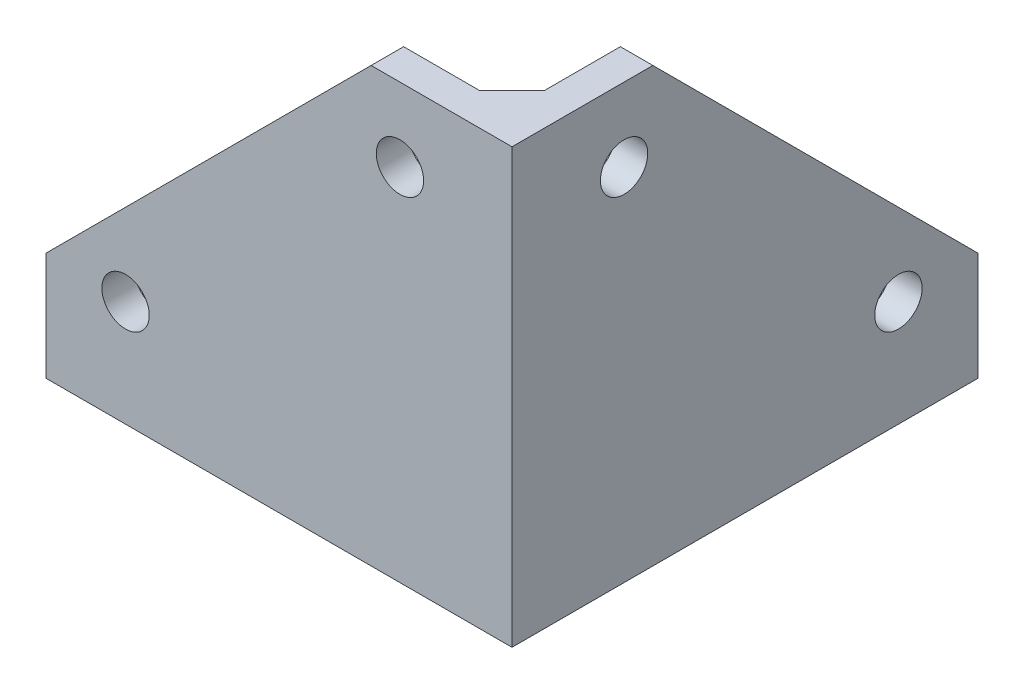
ISO-10303-21;
HEADER;
FILE_DESCRIPTION(('STEP AP214'),'2;1');
FILE_NAME('part.step','',(''),(''),'','','');
FILE_SCHEMA(('AUTOMOTIVE_DESIGN { 1 0 10303 214 1 1 1 1 }'));
ENDSEC;
DATA;
#1=APPLICATION_CONTEXT('core data for automotive mechanical design processes');
#2=APPLICATION_PROTOCOL_DEFINITION('international standard','automotive_design',2000,#1);
#3=PRODUCT_CONTEXT('',#1,'mechanical');
#4=PRODUCT('Part','Part','',(#3));
#5=PRODUCT_RELATED_PRODUCT_CATEGORY('part','',(#4));
#6=PRODUCT_DEFINITION_FORMATION('','',#4);
#7=PRODUCT_DEFINITION_CONTEXT('part definition',#1,'design');
#8=PRODUCT_DEFINITION('design','',#6,#7);
#9=PRODUCT_DEFINITION_SHAPE('','',#8);
#10=(LENGTH_UNIT() NAMED_UNIT(*) SI_UNIT(.MILLI.,.METRE.));
#11=(NAMED_UNIT(*) PLANE_ANGLE_UNIT() SI_UNIT($,.RADIAN.));
#12=(NAMED_UNIT(*) SI_UNIT($,.STERADIAN.) SOLID_ANGLE_UNIT());
#13=UNCERTAINTY_MEASURE_WITH_UNIT(LENGTH_MEASURE(1.E-05),#10,'distance_accuracy_value','');
#14=(GEOMETRIC_REPRESENTATION_CONTEXT(3) GLOBAL_UNCERTAINTY_ASSIGNED_CONTEXT((#13)) GLOBAL_UNIT_ASSIGNED_CONTEXT((#10,
#11,#12)) REPRESENTATION_CONTEXT('',''));
#15=CARTESIAN_POINT('',(0.,0.,0.));
#16=DIRECTION('',(0.,0.,1.));
#17=DIRECTION('',(1.,0.,0.));
#18=AXIS2_PLACEMENT_3D('',#15,#16,#17);
#19=CARTESIAN_POINT('',(-20.,3.,0.));
#20=DIRECTION('',(-1.,0.,0.));
#21=DIRECTION('',(0.,0.,1.));
#22=AXIS2_PLACEMENT_3D('',#19,#20,#21);
#23=PLANE('',#22);
#24=DIRECTION('',(0.,-1.,0.));
#25=VECTOR('',#24,1.);
#26=CARTESIAN_POINT('',(-20.,40.,20.));
#27=LINE('',#26,#25);
#28=CARTESIAN_POINT('',(-20.,9.99999999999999,20.));
#29=VERTEX_POINT('',#28);
#30=CARTESIAN_POINT('',(-20.,5.99999999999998,20.));
#31=VERTEX_POINT('',#30);
#32=EDGE_CURVE('E186',#29,#31,#27,.T.);
#33=ORIENTED_EDGE('',*,*,#32,.T.);
#34=DIRECTION('',(0.,0.707106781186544,0.707106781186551));
#35=VECTOR('',#34,1.);
#36=CARTESIAN_POINT('',(-20.,5.99999999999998,20.));
#37=LINE('',#36,#35);
#38=CARTESIAN_POINT('',(-20.,3.,17.));
#39=VERTEX_POINT('',#38);
#40=EDGE_CURVE('E53',#31,#39,#37,.F.);
#41=ORIENTED_EDGE('',*,*,#40,.T.);
#42=DIRECTION('',(0.,0.,-1.));
#43=VECTOR('',#42,1.);
#44=CARTESIAN_POINT('',(-20.,3.,0.));
#45=LINE('',#44,#43);
#46=CARTESIAN_POINT('',(-20.,3.,9.99999999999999));
#47=VERTEX_POINT('',#46);
#48=EDGE_CURVE('E206',#39,#47,#45,.T.);
#49=ORIENTED_EDGE('',*,*,#48,.T.);
#50=DIRECTION('',(0.,-1.,0.));
#51=VECTOR('',#50,1.);
#52=CARTESIAN_POINT('',(-20.,0.,9.99999999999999));
#53=LINE('',#52,#51);
#54=CARTESIAN_POINT('',(-20.,0.,9.99999999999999));
#55=VERTEX_POINT('',#54);
#56=EDGE_CURVE('E250',#47,#55,#53,.T.);
#57=ORIENTED_EDGE('',*,*,#56,.T.);
#58=DIRECTION('',(0.,0.,-1.));
#59=VECTOR('',#58,1.);
#60=CARTESIAN_POINT('',(-20.,0.,0.));
#61=LINE('',#60,#59);
#62=CARTESIAN_POINT('',(-20.,0.,23.));
#63=VERTEX_POINT('',#62);
#64=EDGE_CURVE('E220',#63,#55,#61,.T.);
#65=ORIENTED_EDGE('',*,*,#64,.F.);
#66=DIRECTION('',(0.,-1.,0.));
#67=VECTOR('',#66,1.);
#68=CARTESIAN_POINT('',(-20.,40.,23.));
#69=LINE('',#68,#67);
#70=CARTESIAN_POINT('',(-20.,9.99999999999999,23.));
#71=VERTEX_POINT('',#70);
#72=EDGE_CURVE('E161',#71,#63,#69,.T.);
#73=ORIENTED_EDGE('',*,*,#72,.F.);
#74=DIRECTION('',(0.,0.,-1.));
#75=VECTOR('',#74,1.);
#76=CARTESIAN_POINT('',(-20.,9.99999999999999,20.));
#77=LINE('',#76,#75);
#78=EDGE_CURVE('E212',#71,#29,#77,.T.);
#79=ORIENTED_EDGE('',*,*,#78,.T.);
#80=EDGE_LOOP('',(#33,#41,#49,#57,#65,#73,#79));
#81=FACE_BOUND('',#80,.T.);
#82=ADVANCED_FACE('F42',(#81),#23,.T.);
#83=CARTESIAN_POINT('',(-14.1977849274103,3.,14.1977849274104));
#84=DIRECTION('',(0.,-1.,0.));
#85=DIRECTION('',(0.,0.,-1.));
#86=AXIS2_PLACEMENT_3D('',#83,#84,#85);
#87=CYLINDRICAL_SURFACE('',#86,2.1844);
#88=CARTESIAN_POINT('',(-14.1977849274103,3.,14.1977849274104));
#89=DIRECTION('',(0.,1.,0.));
#90=DIRECTION('',(0.,0.,1.));
#91=AXIS2_PLACEMENT_3D('',#88,#89,#90);
#92=CIRCLE('',#91,2.1844);
#93=CARTESIAN_POINT('',(-14.1977849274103,3.,16.3821849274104));
#94=VERTEX_POINT('',#93);
#95=EDGE_CURVE('E201',#94,#94,#92,.T.);
#96=ORIENTED_EDGE('',*,*,#95,.T.);
#97=EDGE_LOOP('',(#96));
#98=FACE_BOUND('',#97,.T.);
#99=CARTESIAN_POINT('',(-14.1977849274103,0.,14.1977849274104));
#100=DIRECTION('',(0.,1.,0.));
#101=DIRECTION('',(0.,0.,1.));
#102=AXIS2_PLACEMENT_3D('',#99,#100,#101);
#103=CIRCLE('',#102,2.1844);
#104=CARTESIAN_POINT('',(-14.1977849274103,0.,16.3821849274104));
#105=VERTEX_POINT('',#104);
#106=EDGE_CURVE('E216',#105,#105,#103,.T.);
#107=ORIENTED_EDGE('',*,*,#106,.F.);
#108=EDGE_LOOP('',(#107));
#109=FACE_BOUND('',#108,.T.);
#110=ADVANCED_FACE('F364',(#98,#109),#87,.F.);
#111=CARTESIAN_POINT('',(14.1977849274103,3.,-14.1977849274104));
#112=DIRECTION('',(0.,-1.,0.));
#113=DIRECTION('',(0.,0.,-1.));
#114=AXIS2_PLACEMENT_3D('',#111,#112,#113);
#115=CYLINDRICAL_SURFACE('',#114,2.1844);
#116=CARTESIAN_POINT('',(14.1977849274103,3.,-14.1977849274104));
#117=DIRECTION('',(0.,1.,0.));
#118=DIRECTION('',(0.,0.,1.));
#119=AXIS2_PLACEMENT_3D('',#116,#117,#118);
#120=CIRCLE('',#119,2.1844);
#121=CARTESIAN_POINT('',(14.1977849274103,3.,-12.0133849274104));
#122=VERTEX_POINT('',#121);
#123=EDGE_CURVE('E197',#122,#122,#120,.T.);
#124=ORIENTED_EDGE('',*,*,#123,.T.);
#125=EDGE_LOOP('',(#124));
#126=FACE_BOUND('',#125,.T.);
#127=CARTESIAN_POINT('',(14.1977849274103,0.,-14.1977849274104));
#128=DIRECTION('',(0.,1.,0.));
#129=DIRECTION('',(0.,0.,1.));
#130=AXIS2_PLACEMENT_3D('',#127,#128,#129);
#131=CIRCLE('',#130,2.1844);
#132=CARTESIAN_POINT('',(14.1977849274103,0.,-12.0133849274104));
#133=VERTEX_POINT('',#132);
#134=EDGE_CURVE('E196',#133,#133,#131,.T.);
#135=ORIENTED_EDGE('',*,*,#134,.F.);
#136=EDGE_LOOP('',(#135));
#137=FACE_BOUND('',#136,.T.);
#138=ADVANCED_FACE('F369',(#126,#137),#115,.F.);
#139=CARTESIAN_POINT('',(0.,3.,-20.));
#140=DIRECTION('',(0.,0.,1.));
#141=DIRECTION('',(1.,0.,0.));
#142=AXIS2_PLACEMENT_3D('',#139,#140,#141);
#143=PLANE('',#142);
#144=DIRECTION('',(-1.,0.,0.));
#145=VECTOR('',#144,1.);
#146=CARTESIAN_POINT('',(0.,0.,-20.));
#147=LINE('',#146,#145);
#148=CARTESIAN_POINT('',(23.,0.,-20.));
#149=VERTEX_POINT('',#148);
#150=CARTESIAN_POINT('',(10.,0.,-20.));
#151=VERTEX_POINT('',#150);
#152=EDGE_CURVE('E202',#149,#151,#147,.T.);
#153=ORIENTED_EDGE('',*,*,#152,.T.);
#154=DIRECTION('',(0.,-1.,0.));
#155=VECTOR('',#154,1.);
#156=CARTESIAN_POINT('',(10.,3.,-20.));
#157=LINE('',#156,#155);
#158=CARTESIAN_POINT('',(10.,3.,-20.));
#159=VERTEX_POINT('',#158);
#160=EDGE_CURVE('E257',#151,#159,#157,.F.);
#161=ORIENTED_EDGE('',*,*,#160,.T.);
#162=DIRECTION('',(-1.,0.,0.));
#163=VECTOR('',#162,1.);
#164=CARTESIAN_POINT('',(0.,3.,-20.));
#165=LINE('',#164,#163);
#166=CARTESIAN_POINT('',(17.,3.,-20.));
#167=VERTEX_POINT('',#166);
#168=EDGE_CURVE('E209',#167,#159,#165,.T.);
#169=ORIENTED_EDGE('',*,*,#168,.F.);
#170=DIRECTION('',(-0.707106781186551,-0.707106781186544,0.));
#171=VECTOR('',#170,1.);
#172=CARTESIAN_POINT('',(8.4999999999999,-5.49999999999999,-20.));
#173=LINE('',#172,#171);
#174=CARTESIAN_POINT('',(20.,5.99999999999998,-20.));
#175=VERTEX_POINT('',#174);
#176=EDGE_CURVE('E11',#167,#175,#173,.F.);
#177=ORIENTED_EDGE('',*,*,#176,.T.);
#178=DIRECTION('',(0.,-1.,0.));
#179=VECTOR('',#178,1.);
#180=CARTESIAN_POINT('',(20.,40.,-20.));
#181=LINE('',#180,#179);
#182=CARTESIAN_POINT('',(20.,10.,-20.));
#183=VERTEX_POINT('',#182);
#184=EDGE_CURVE('E189',#183,#175,#181,.T.);
#185=ORIENTED_EDGE('',*,*,#184,.F.);
#186=DIRECTION('',(1.,0.,0.));
#187=VECTOR('',#186,1.);
#188=CARTESIAN_POINT('',(0.,10.,-20.));
#189=LINE('',#188,#187);
#190=CARTESIAN_POINT('',(23.,10.,-20.));
#191=VERTEX_POINT('',#190);
#192=EDGE_CURVE('E241',#183,#191,#189,.T.);
#193=ORIENTED_EDGE('',*,*,#192,.T.);
#194=DIRECTION('',(0.,-1.,0.));
#195=VECTOR('',#194,1.);
#196=CARTESIAN_POINT('',(23.,40.,-20.));
#197=LINE('',#196,#195);
#198=EDGE_CURVE('E193',#191,#149,#197,.T.);
#199=ORIENTED_EDGE('',*,*,#198,.T.);
#200=EDGE_LOOP('',(#153,#161,#169,#177,#185,#193,#199));
#201=FACE_BOUND('',#200,.T.);
#202=ADVANCED_FACE('F373',(#201),#143,.F.);
#203=CARTESIAN_POINT('',(0.,3.,0.));
#204=DIRECTION('',(0.,1.,0.));
#205=DIRECTION('',(0.,0.,1.));
#206=AXIS2_PLACEMENT_3D('',#203,#204,#205);
#207=PLANE('',#206);
#208=ORIENTED_EDGE('',*,*,#123,.F.);
#209=EDGE_LOOP('',(#208));
#210=FACE_BOUND('',#209,.T.);
#211=ORIENTED_EDGE('',*,*,#95,.F.);
#212=EDGE_LOOP('',(#211));
#213=FACE_BOUND('',#212,.T.);
#214=ORIENTED_EDGE('',*,*,#48,.F.);
#215=DIRECTION('',(1.,0.,0.));
#216=VECTOR('',#215,1.);
#217=CARTESIAN_POINT('',(20.,3.,17.));
#218=LINE('',#217,#216);
#219=CARTESIAN_POINT('',(17.,3.,17.));
#220=VERTEX_POINT('',#219);
#221=EDGE_CURVE('E61',#39,#220,#218,.T.);
#222=ORIENTED_EDGE('',*,*,#221,.T.);
#223=DIRECTION('',(0.,0.,-1.));
#224=VECTOR('',#223,1.);
#225=CARTESIAN_POINT('',(17.,3.,-20.));
#226=LINE('',#225,#224);
#227=EDGE_CURVE('E278',#220,#167,#226,.T.);
#228=ORIENTED_EDGE('',*,*,#227,.T.);
#229=ORIENTED_EDGE('',*,*,#168,.T.);
#230=CARTESIAN_POINT('',(10.,3.,9.99999999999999));
#231=DIRECTION('',(0.,1.,0.));
#232=DIRECTION('',(0.,0.,1.));
#233=AXIS2_PLACEMENT_3D('',#230,#231,#232);
#234=CIRCLE('',#233,30.);
#235=EDGE_CURVE('E261',#159,#47,#234,.T.);
#236=ORIENTED_EDGE('',*,*,#235,.T.);
#237=EDGE_LOOP('',(#214,#222,#228,#229,#236));
#238=FACE_BOUND('',#237,.T.);
#239=ADVANCED_FACE('F413',(#210,#213,#238),#207,.T.);
#240=CARTESIAN_POINT('',(0.,0.,0.));
#241=DIRECTION('',(0.,1.,0.));
#242=DIRECTION('',(0.,0.,1.));
#243=AXIS2_PLACEMENT_3D('',#240,#241,#242);
#244=PLANE('',#243);
#245=ORIENTED_EDGE('',*,*,#64,.T.);
#246=CARTESIAN_POINT('',(10.,0.,9.99999999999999));
#247=DIRECTION('',(0.,1.,0.));
#248=DIRECTION('',(0.,0.,1.));
#249=AXIS2_PLACEMENT_3D('',#246,#247,#248);
#250=CIRCLE('',#249,30.);
#251=EDGE_CURVE('E254',#55,#151,#250,.F.);
#252=ORIENTED_EDGE('',*,*,#251,.T.);
#253=ORIENTED_EDGE('',*,*,#152,.F.);
#254=DIRECTION('',(0.,0.,-1.));
#255=VECTOR('',#254,1.);
#256=CARTESIAN_POINT('',(23.,0.,20.));
#257=LINE('',#256,#255);
#258=CARTESIAN_POINT('',(23.,0.,23.));
#259=VERTEX_POINT('',#258);
#260=EDGE_CURVE('E172',#259,#149,#257,.T.);
#261=ORIENTED_EDGE('',*,*,#260,.F.);
#262=DIRECTION('',(1.,0.,0.));
#263=VECTOR('',#262,1.);
#264=CARTESIAN_POINT('',(-20.,0.,23.));
#265=LINE('',#264,#263);
#266=EDGE_CURVE('E156',#63,#259,#265,.T.);
#267=ORIENTED_EDGE('',*,*,#266,.F.);
#268=EDGE_LOOP('',(#245,#252,#253,#261,#267));
#269=FACE_BOUND('',#268,.T.);
#270=ORIENTED_EDGE('',*,*,#134,.T.);
#271=EDGE_LOOP('',(#270));
#272=FACE_BOUND('',#271,.T.);
#273=ORIENTED_EDGE('',*,*,#106,.T.);
#274=EDGE_LOOP('',(#273));
#275=FACE_BOUND('',#274,.T.);
#276=ADVANCED_FACE('F419',(#269,#272,#275),#244,.F.);
#277=CARTESIAN_POINT('',(23.,40.,20.));
#278=DIRECTION('',(-1.,0.,0.));
#279=DIRECTION('',(0.,0.,1.));
#280=AXIS2_PLACEMENT_3D('',#277,#278,#279);
#281=PLANE('',#280);
#282=CARTESIAN_POINT('',(23.,33.2095801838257,12.6590056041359));
#283=DIRECTION('',(-1.,0.,0.));
#284=DIRECTION('',(0.,0.,1.));
#285=AXIS2_PLACEMENT_3D('',#282,#283,#284);
#286=CIRCLE('',#285,2.1844);
#287=CARTESIAN_POINT('',(23.,33.2095801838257,14.8434056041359));
#288=VERTEX_POINT('',#287);
#289=EDGE_CURVE('E182',#288,#288,#286,.T.);
#290=ORIENTED_EDGE('',*,*,#289,.T.);
#291=EDGE_LOOP('',(#290));
#292=FACE_BOUND('',#291,.T.);
#293=CARTESIAN_POINT('',(23.,9.79041981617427,-12.6590056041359));
#294=DIRECTION('',(-1.,0.,0.));
#295=DIRECTION('',(0.,0.,-1.));
#296=AXIS2_PLACEMENT_3D('',#293,#294,#295);
#297=CIRCLE('',#296,2.18440000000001);
#298=CARTESIAN_POINT('',(23.,9.79041981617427,-14.8434056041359));
#299=VERTEX_POINT('',#298);
#300=EDGE_CURVE('E319',#299,#299,#297,.T.);
#301=ORIENTED_EDGE('',*,*,#300,.T.);
#302=EDGE_LOOP('',(#301));
#303=FACE_BOUND('',#302,.T.);
#304=ORIENTED_EDGE('',*,*,#198,.F.);
#305=DIRECTION('',(0.,-0.707106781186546,-0.707106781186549));
#306=VECTOR('',#305,1.);
#307=CARTESIAN_POINT('',(23.,10.,-20.));
#308=LINE('',#307,#306);
#309=CARTESIAN_POINT('',(23.,40.,10.0000000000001));
#310=VERTEX_POINT('',#309);
#311=EDGE_CURVE('E165',#191,#310,#308,.F.);
#312=ORIENTED_EDGE('',*,*,#311,.T.);
#313=DIRECTION('',(0.,0.,-1.));
#314=VECTOR('',#313,1.);
#315=CARTESIAN_POINT('',(23.,40.,20.));
#316=LINE('',#315,#314);
#317=CARTESIAN_POINT('',(23.,40.,23.));
#318=VERTEX_POINT('',#317);
#319=EDGE_CURVE('E143',#318,#310,#316,.T.);
#320=ORIENTED_EDGE('',*,*,#319,.F.);
#321=DIRECTION('',(0.,-1.,0.));
#322=VECTOR('',#321,1.);
#323=CARTESIAN_POINT('',(23.,40.,23.));
#324=LINE('',#323,#322);
#325=EDGE_CURVE('E150',#318,#259,#324,.T.);
#326=ORIENTED_EDGE('',*,*,#325,.T.);
#327=ORIENTED_EDGE('',*,*,#260,.T.);
#328=EDGE_LOOP('',(#304,#312,#320,#326,#327));
#329=FACE_BOUND('',#328,.T.);
#330=ADVANCED_FACE('F164',(#292,#303,#329),#281,.F.);
#331=CARTESIAN_POINT('',(20.,40.,20.));
#332=DIRECTION('',(-1.,0.,0.));
#333=DIRECTION('',(0.,0.,1.));
#334=AXIS2_PLACEMENT_3D('',#331,#332,#333);
#335=PLANE('',#334);
#336=CARTESIAN_POINT('',(20.,33.2095801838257,12.6590056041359));
#337=DIRECTION('',(-1.,0.,0.));
#338=DIRECTION('',(0.,0.,1.));
#339=AXIS2_PLACEMENT_3D('',#336,#337,#338);
#340=CIRCLE('',#339,2.1844);
#341=CARTESIAN_POINT('',(20.,33.2095801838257,14.8434056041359));
#342=VERTEX_POINT('',#341);
#343=EDGE_CURVE('E316',#342,#342,#340,.T.);
#344=ORIENTED_EDGE('',*,*,#343,.F.);
#345=EDGE_LOOP('',(#344));
#346=FACE_BOUND('',#345,.T.);
#347=CARTESIAN_POINT('',(20.,9.79041981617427,-12.6590056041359));
#348=DIRECTION('',(-1.,0.,0.));
#349=DIRECTION('',(0.,0.,-1.));
#350=AXIS2_PLACEMENT_3D('',#347,#348,#349);
#351=CIRCLE('',#350,2.18440000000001);
#352=CARTESIAN_POINT('',(20.,9.79041981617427,-14.8434056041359));
#353=VERTEX_POINT('',#352);
#354=EDGE_CURVE('E175',#353,#353,#351,.T.);
#355=ORIENTED_EDGE('',*,*,#354,.F.);
#356=EDGE_LOOP('',(#355));
#357=FACE_BOUND('',#356,.T.);
#358=DIRECTION('',(0.,0.,1.));
#359=VECTOR('',#358,1.);
#360=CARTESIAN_POINT('',(20.,5.99999999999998,20.));
#361=LINE('',#360,#359);
#362=CARTESIAN_POINT('',(20.,5.99999999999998,17.));
#363=VERTEX_POINT('',#362);
#364=EDGE_CURVE('E272',#175,#363,#361,.T.);
#365=ORIENTED_EDGE('',*,*,#364,.T.);
#366=DIRECTION('',(0.,1.,0.));
#367=VECTOR('',#366,1.);
#368=CARTESIAN_POINT('',(20.,40.,17.));
#369=LINE('',#368,#367);
#370=CARTESIAN_POINT('',(20.,40.,17.));
#371=VERTEX_POINT('',#370);
#372=EDGE_CURVE('E275',#363,#371,#369,.T.);
#373=ORIENTED_EDGE('',*,*,#372,.T.);
#374=DIRECTION('',(0.,0.,-1.));
#375=VECTOR('',#374,1.);
#376=CARTESIAN_POINT('',(20.,40.,20.));
#377=LINE('',#376,#375);
#378=CARTESIAN_POINT('',(20.,40.,10.0000000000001));
#379=VERTEX_POINT('',#378);
#380=EDGE_CURVE('E167',#371,#379,#377,.T.);
#381=ORIENTED_EDGE('',*,*,#380,.T.);
#382=DIRECTION('',(0.,0.707106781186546,0.707106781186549));
#383=VECTOR('',#382,1.);
#384=CARTESIAN_POINT('',(20.,45.,15.0000000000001));
#385=LINE('',#384,#383);
#386=EDGE_CURVE('E247',#379,#183,#385,.F.);
#387=ORIENTED_EDGE('',*,*,#386,.T.);
#388=ORIENTED_EDGE('',*,*,#184,.T.);
#389=EDGE_LOOP('',(#365,#373,#381,#387,#388));
#390=FACE_BOUND('',#389,.T.);
#391=ADVANCED_FACE('F343',(#346,#357,#390),#335,.T.);
#392=CARTESIAN_POINT('',(-20.,40.,20.));
#393=DIRECTION('',(0.,0.,-1.));
#394=DIRECTION('',(-1.,0.,0.));
#395=AXIS2_PLACEMENT_3D('',#392,#393,#394);
#396=PLANE('',#395);
#397=CARTESIAN_POINT('',(12.6590056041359,33.2095801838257,20.));
#398=DIRECTION('',(0.,0.,-1.));
#399=DIRECTION('',(-1.,0.,0.));
#400=AXIS2_PLACEMENT_3D('',#397,#398,#399);
#401=CIRCLE('',#400,2.1844);
#402=CARTESIAN_POINT('',(10.4746056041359,33.2095801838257,20.));
#403=VERTEX_POINT('',#402);
#404=EDGE_CURVE('E309',#403,#403,#401,.T.);
#405=ORIENTED_EDGE('',*,*,#404,.F.);
#406=EDGE_LOOP('',(#405));
#407=FACE_BOUND('',#406,.T.);
#408=CARTESIAN_POINT('',(-12.6590056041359,9.79041981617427,20.));
#409=DIRECTION('',(0.,0.,-1.));
#410=DIRECTION('',(1.,0.,0.));
#411=AXIS2_PLACEMENT_3D('',#408,#409,#410);
#412=CIRCLE('',#411,2.1844);
#413=CARTESIAN_POINT('',(-14.8434056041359,9.79041981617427,20.));
#414=VERTEX_POINT('',#413);
#415=EDGE_CURVE('E298',#414,#414,#412,.T.);
#416=ORIENTED_EDGE('',*,*,#415,.F.);
#417=EDGE_LOOP('',(#416));
#418=FACE_BOUND('',#417,.T.);
#419=DIRECTION('',(1.,0.,0.));
#420=VECTOR('',#419,1.);
#421=CARTESIAN_POINT('',(-20.,40.,20.));
#422=LINE('',#421,#420);
#423=CARTESIAN_POINT('',(10.0000000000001,40.,20.));
#424=VERTEX_POINT('',#423);
#425=CARTESIAN_POINT('',(17.,40.,20.));
#426=VERTEX_POINT('',#425);
#427=EDGE_CURVE('E151',#424,#426,#422,.T.);
#428=ORIENTED_EDGE('',*,*,#427,.T.);
#429=DIRECTION('',(0.,-1.,0.));
#430=VECTOR('',#429,1.);
#431=CARTESIAN_POINT('',(17.,3.,20.));
#432=LINE('',#431,#430);
#433=CARTESIAN_POINT('',(17.,5.99999999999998,20.));
#434=VERTEX_POINT('',#433);
#435=EDGE_CURVE('E268',#426,#434,#432,.T.);
#436=ORIENTED_EDGE('',*,*,#435,.T.);
#437=DIRECTION('',(-1.,0.,0.));
#438=VECTOR('',#437,1.);
#439=CARTESIAN_POINT('',(-20.,5.99999999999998,20.));
#440=LINE('',#439,#438);
#441=EDGE_CURVE('E265',#434,#31,#440,.T.);
#442=ORIENTED_EDGE('',*,*,#441,.T.);
#443=ORIENTED_EDGE('',*,*,#32,.F.);
#444=DIRECTION('',(0.707106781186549,0.707106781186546,0.));
#445=VECTOR('',#444,1.);
#446=CARTESIAN_POINT('',(-4.99999999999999,24.9999999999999,20.));
#447=LINE('',#446,#445);
#448=EDGE_CURVE('E230',#29,#424,#447,.T.);
#449=ORIENTED_EDGE('',*,*,#448,.T.);
#450=EDGE_LOOP('',(#428,#436,#442,#443,#449));
#451=FACE_BOUND('',#450,.T.);
#452=ADVANCED_FACE('F340',(#407,#418,#451),#396,.T.);
#453=CARTESIAN_POINT('',(-20.,40.,23.));
#454=DIRECTION('',(0.,0.,-1.));
#455=DIRECTION('',(-1.,0.,0.));
#456=AXIS2_PLACEMENT_3D('',#453,#454,#455);
#457=PLANE('',#456);
#458=CARTESIAN_POINT('',(12.6590056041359,33.2095801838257,23.));
#459=DIRECTION('',(0.,0.,-1.));
#460=DIRECTION('',(-1.,0.,0.));
#461=AXIS2_PLACEMENT_3D('',#458,#459,#460);
#462=CIRCLE('',#461,2.1844);
#463=CARTESIAN_POINT('',(10.4746056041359,33.2095801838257,23.));
#464=VERTEX_POINT('',#463);
#465=EDGE_CURVE('E326',#464,#464,#462,.T.);
#466=ORIENTED_EDGE('',*,*,#465,.T.);
#467=EDGE_LOOP('',(#466));
#468=FACE_BOUND('',#467,.T.);
#469=CARTESIAN_POINT('',(-12.6590056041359,9.79041981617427,23.));
#470=DIRECTION('',(0.,0.,-1.));
#471=DIRECTION('',(1.,0.,0.));
#472=AXIS2_PLACEMENT_3D('',#469,#470,#471);
#473=CIRCLE('',#472,2.1844);
#474=CARTESIAN_POINT('',(-14.8434056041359,9.79041981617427,23.));
#475=VERTEX_POINT('',#474);
#476=EDGE_CURVE('E303',#475,#475,#473,.T.);
#477=ORIENTED_EDGE('',*,*,#476,.T.);
#478=EDGE_LOOP('',(#477));
#479=FACE_BOUND('',#478,.T.);
#480=DIRECTION('',(1.,0.,0.));
#481=VECTOR('',#480,1.);
#482=CARTESIAN_POINT('',(-20.,40.,23.));
#483=LINE('',#482,#481);
#484=CARTESIAN_POINT('',(10.0000000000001,40.,23.));
#485=VERTEX_POINT('',#484);
#486=EDGE_CURVE('E137',#485,#318,#483,.T.);
#487=ORIENTED_EDGE('',*,*,#486,.F.);
#488=DIRECTION('',(-0.707106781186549,-0.707106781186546,0.));
#489=VECTOR('',#488,1.);
#490=CARTESIAN_POINT('',(-20.,9.99999999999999,23.));
#491=LINE('',#490,#489);
#492=EDGE_CURVE('E238',#485,#71,#491,.T.);
#493=ORIENTED_EDGE('',*,*,#492,.T.);
#494=ORIENTED_EDGE('',*,*,#72,.T.);
#495=ORIENTED_EDGE('',*,*,#266,.T.);
#496=ORIENTED_EDGE('',*,*,#325,.F.);
#497=EDGE_LOOP('',(#487,#493,#494,#495,#496));
#498=FACE_BOUND('',#497,.T.);
#499=ADVANCED_FACE('F154',(#468,#479,#498),#457,.F.);
#500=CARTESIAN_POINT('',(0.,40.,0.));
#501=DIRECTION('',(0.,-1.,0.));
#502=DIRECTION('',(-1.,0.,0.));
#503=AXIS2_PLACEMENT_3D('',#500,#501,#502);
#504=PLANE('',#503);
#505=ORIENTED_EDGE('',*,*,#427,.F.);
#506=DIRECTION('',(0.,0.,1.));
#507=VECTOR('',#506,1.);
#508=CARTESIAN_POINT('',(10.0000000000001,40.,23.));
#509=LINE('',#508,#507);
#510=EDGE_CURVE('E146',#424,#485,#509,.T.);
#511=ORIENTED_EDGE('',*,*,#510,.T.);
#512=ORIENTED_EDGE('',*,*,#486,.T.);
#513=ORIENTED_EDGE('',*,*,#319,.T.);
#514=DIRECTION('',(-1.,0.,0.));
#515=VECTOR('',#514,1.);
#516=CARTESIAN_POINT('',(0.,40.,10.0000000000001));
#517=LINE('',#516,#515);
#518=EDGE_CURVE('E233',#310,#379,#517,.T.);
#519=ORIENTED_EDGE('',*,*,#518,.T.);
#520=ORIENTED_EDGE('',*,*,#380,.F.);
#521=DIRECTION('',(0.707106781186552,0.,-0.707106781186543));
#522=VECTOR('',#521,1.);
#523=CARTESIAN_POINT('',(18.4999999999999,40.,18.5000000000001));
#524=LINE('',#523,#522);
#525=EDGE_CURVE('E283',#371,#426,#524,.F.);
#526=ORIENTED_EDGE('',*,*,#525,.T.);
#527=EDGE_LOOP('',(#505,#511,#512,#513,#519,#520,#526));
#528=FACE_BOUND('',#527,.T.);
#529=ADVANCED_FACE('F140',(#528),#504,.F.);
#530=CARTESIAN_POINT('',(23.,9.79041981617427,-12.6590056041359));
#531=DIRECTION('',(-1.,0.,0.));
#532=DIRECTION('',(0.,0.,1.));
#533=AXIS2_PLACEMENT_3D('',#530,#531,#532);
#534=CYLINDRICAL_SURFACE('',#533,2.18440000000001);
#535=ORIENTED_EDGE('',*,*,#300,.F.);
#536=EDGE_LOOP('',(#535));
#537=FACE_BOUND('',#536,.T.);
#538=ORIENTED_EDGE('',*,*,#354,.T.);
#539=EDGE_LOOP('',(#538));
#540=FACE_BOUND('',#539,.T.);
#541=ADVANCED_FACE('F446',(#537,#540),#534,.F.);
#542=CARTESIAN_POINT('',(23.,33.2095801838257,12.6590056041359));
#543=DIRECTION('',(-1.,0.,0.));
#544=DIRECTION('',(0.,0.,1.));
#545=AXIS2_PLACEMENT_3D('',#542,#543,#544);
#546=CYLINDRICAL_SURFACE('',#545,2.1844);
#547=ORIENTED_EDGE('',*,*,#289,.F.);
#548=EDGE_LOOP('',(#547));
#549=FACE_BOUND('',#548,.T.);
#550=ORIENTED_EDGE('',*,*,#343,.T.);
#551=EDGE_LOOP('',(#550));
#552=FACE_BOUND('',#551,.T.);
#553=ADVANCED_FACE('F449',(#549,#552),#546,.F.);
#554=CARTESIAN_POINT('',(-12.6590056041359,9.79041981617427,23.));
#555=DIRECTION('',(0.,0.,-1.));
#556=DIRECTION('',(-1.,0.,0.));
#557=AXIS2_PLACEMENT_3D('',#554,#555,#556);
#558=CYLINDRICAL_SURFACE('',#557,2.1844);
#559=CARTESIAN_POINT('',(-14.8434056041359,9.79041981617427,23.));
#560=CARTESIAN_POINT('',(-14.8434056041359,9.79041981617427,22.96875));
#561=CARTESIAN_POINT('',(-14.8434056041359,9.79041981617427,22.9375));
#562=CARTESIAN_POINT('',(-14.8434056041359,9.79041981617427,22.875));
#563=CARTESIAN_POINT('',(-14.8434056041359,9.79041981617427,22.84375));
#564=CARTESIAN_POINT('',(-14.8434056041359,9.79041981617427,22.78125));
#565=CARTESIAN_POINT('',(-14.8434056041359,9.79041981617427,22.75));
#566=CARTESIAN_POINT('',(-14.8434056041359,9.79041981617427,22.6875));
#567=CARTESIAN_POINT('',(-14.8434056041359,9.79041981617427,22.65625));
#568=CARTESIAN_POINT('',(-14.8434056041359,9.79041981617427,22.59375));
#569=CARTESIAN_POINT('',(-14.8434056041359,9.79041981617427,22.5625));
#570=CARTESIAN_POINT('',(-14.8434056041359,9.79041981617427,22.5));
#571=CARTESIAN_POINT('',(-14.8434056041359,9.79041981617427,22.46875));
#572=CARTESIAN_POINT('',(-14.8434056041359,9.79041981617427,22.40625));
#573=CARTESIAN_POINT('',(-14.8434056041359,9.79041981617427,22.375));
#574=CARTESIAN_POINT('',(-14.8434056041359,9.79041981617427,22.3125));
#575=CARTESIAN_POINT('',(-14.8434056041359,9.79041981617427,22.28125));
#576=CARTESIAN_POINT('',(-14.8434056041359,9.79041981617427,22.21875));
#577=CARTESIAN_POINT('',(-14.8434056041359,9.79041981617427,22.1875));
#578=CARTESIAN_POINT('',(-14.8434056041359,9.79041981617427,22.125));
#579=CARTESIAN_POINT('',(-14.8434056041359,9.79041981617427,22.09375));
#580=CARTESIAN_POINT('',(-14.8434056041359,9.79041981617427,22.03125));
#581=CARTESIAN_POINT('',(-14.8434056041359,9.79041981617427,22.));
#582=CARTESIAN_POINT('',(-14.8434056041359,9.79041981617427,21.9375));
#583=CARTESIAN_POINT('',(-14.8434056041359,9.79041981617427,21.90625));
#584=CARTESIAN_POINT('',(-14.8434056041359,9.79041981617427,21.84375));
#585=CARTESIAN_POINT('',(-14.8434056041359,9.79041981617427,21.8125));
#586=CARTESIAN_POINT('',(-14.8434056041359,9.79041981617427,21.75));
#587=CARTESIAN_POINT('',(-14.8434056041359,9.79041981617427,21.71875));
#588=CARTESIAN_POINT('',(-14.8434056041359,9.79041981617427,21.65625));
#589=CARTESIAN_POINT('',(-14.8434056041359,9.79041981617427,21.625));
#590=CARTESIAN_POINT('',(-14.8434056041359,9.79041981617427,21.5625));
#591=CARTESIAN_POINT('',(-14.8434056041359,9.79041981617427,21.53125));
#592=CARTESIAN_POINT('',(-14.8434056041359,9.79041981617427,21.46875));
#593=CARTESIAN_POINT('',(-14.8434056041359,9.79041981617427,21.4375));
#594=CARTESIAN_POINT('',(-14.8434056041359,9.79041981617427,21.375));
#595=CARTESIAN_POINT('',(-14.8434056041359,9.79041981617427,21.34375));
#596=CARTESIAN_POINT('',(-14.8434056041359,9.79041981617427,21.28125));
#597=CARTESIAN_POINT('',(-14.8434056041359,9.79041981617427,21.25));
#598=CARTESIAN_POINT('',(-14.8434056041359,9.79041981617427,21.1875));
#599=CARTESIAN_POINT('',(-14.8434056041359,9.79041981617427,21.15625));
#600=CARTESIAN_POINT('',(-14.8434056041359,9.79041981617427,21.09375));
#601=CARTESIAN_POINT('',(-14.8434056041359,9.79041981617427,21.0625));
#602=CARTESIAN_POINT('',(-14.8434056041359,9.79041981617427,21.));
#603=CARTESIAN_POINT('',(-14.8434056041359,9.79041981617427,20.96875));
#604=CARTESIAN_POINT('',(-14.8434056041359,9.79041981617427,20.90625));
#605=CARTESIAN_POINT('',(-14.8434056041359,9.79041981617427,20.875));
#606=CARTESIAN_POINT('',(-14.8434056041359,9.79041981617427,20.8125));
#607=CARTESIAN_POINT('',(-14.8434056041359,9.79041981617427,20.78125));
#608=CARTESIAN_POINT('',(-14.8434056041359,9.79041981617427,20.71875));
#609=CARTESIAN_POINT('',(-14.8434056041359,9.79041981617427,20.6875));
#610=CARTESIAN_POINT('',(-14.8434056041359,9.79041981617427,20.625));
#611=CARTESIAN_POINT('',(-14.8434056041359,9.79041981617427,20.59375));
#612=CARTESIAN_POINT('',(-14.8434056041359,9.79041981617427,20.53125));
#613=CARTESIAN_POINT('',(-14.8434056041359,9.79041981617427,20.5));
#614=CARTESIAN_POINT('',(-14.8434056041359,9.79041981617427,20.4375));
#615=CARTESIAN_POINT('',(-14.8434056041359,9.79041981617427,20.40625));
#616=CARTESIAN_POINT('',(-14.8434056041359,9.79041981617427,20.34375));
#617=CARTESIAN_POINT('',(-14.8434056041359,9.79041981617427,20.3125));
#618=CARTESIAN_POINT('',(-14.8434056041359,9.79041981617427,20.25));
#619=CARTESIAN_POINT('',(-14.8434056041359,9.79041981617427,20.21875));
#620=CARTESIAN_POINT('',(-14.8434056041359,9.79041981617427,20.15625));
#621=CARTESIAN_POINT('',(-14.8434056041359,9.79041981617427,20.125));
#622=CARTESIAN_POINT('',(-14.8434056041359,9.79041981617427,20.0625));
#623=CARTESIAN_POINT('',(-14.8434056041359,9.79041981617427,20.03125));
#624=CARTESIAN_POINT('',(-14.8434056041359,9.79041981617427,20.));
#625=B_SPLINE_CURVE_WITH_KNOTS('',3,(#559,#560,#561,#562,#563,#564,#565,#566,#567,#568,#569,
#570,#571,#572,#573,#574,#575,#576,#577,#578,#579,#580,#581,#582,#583,#584,#585,#586,#587,#588,
#589,#590,#591,#592,#593,#594,#595,#596,#597,#598,#599,#600,#601,#602,#603,#604,#605,#606,#607,
#608,#609,#610,#611,#612,#613,#614,#615,#616,#617,#618,#619,#620,#621,#622,#623,#624),
.UNSPECIFIED.,.F.,.F.,(4,2,2,2,2,2,2,2,2,2,2,2,2,2,2,2,2,2,2,2,2,2,2,2,2,2,2,2,2,2,2,2,4),(0.,
0.0937499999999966,0.187499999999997,0.281249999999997,0.374999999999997,0.468749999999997,
0.562499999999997,0.656249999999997,0.749999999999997,0.843749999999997,0.937499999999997,
1.03125,1.125,1.21875,1.3125,1.40625,1.5,1.59375,1.6875,1.78125,1.875,1.96875,2.0625,2.15625,
2.25,2.34375,2.4375,2.53125,2.625,2.71875,2.8125,2.90625,3.),.UNSPECIFIED.);
#626=EDGE_CURVE('BSEAM453',#475,#414,#625,.T.);
#627=ORIENTED_EDGE('',*,*,#476,.F.);
#628=ORIENTED_EDGE('',*,*,#415,.T.);
#629=ORIENTED_EDGE('',*,*,#626,.T.);
#630=ORIENTED_EDGE('',*,*,#626,.F.);
#631=EDGE_LOOP('',(#627,#629,#628,#630));
#632=FACE_BOUND('',#631,.T.);
#633=ADVANCED_FACE('F453',(#632),#558,.F.);
#634=CARTESIAN_POINT('',(12.6590056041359,33.2095801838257,23.));
#635=DIRECTION('',(0.,0.,-1.));
#636=DIRECTION('',(-1.,0.,0.));
#637=AXIS2_PLACEMENT_3D('',#634,#635,#636);
#638=CYLINDRICAL_SURFACE('',#637,2.1844);
#639=CARTESIAN_POINT('',(10.4746056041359,33.2095801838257,23.));
#640=CARTESIAN_POINT('',(10.4746056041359,33.2095801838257,22.96875));
#641=CARTESIAN_POINT('',(10.4746056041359,33.2095801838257,22.9375));
#642=CARTESIAN_POINT('',(10.4746056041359,33.2095801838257,22.875));
#643=CARTESIAN_POINT('',(10.4746056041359,33.2095801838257,22.84375));
#644=CARTESIAN_POINT('',(10.4746056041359,33.2095801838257,22.78125));
#645=CARTESIAN_POINT('',(10.4746056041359,33.2095801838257,22.75));
#646=CARTESIAN_POINT('',(10.4746056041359,33.2095801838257,22.6875));
#647=CARTESIAN_POINT('',(10.4746056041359,33.2095801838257,22.65625));
#648=CARTESIAN_POINT('',(10.4746056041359,33.2095801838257,22.59375));
#649=CARTESIAN_POINT('',(10.4746056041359,33.2095801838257,22.5625));
#650=CARTESIAN_POINT('',(10.4746056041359,33.2095801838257,22.5));
#651=CARTESIAN_POINT('',(10.4746056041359,33.2095801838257,22.46875));
#652=CARTESIAN_POINT('',(10.4746056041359,33.2095801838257,22.40625));
#653=CARTESIAN_POINT('',(10.4746056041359,33.2095801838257,22.375));
#654=CARTESIAN_POINT('',(10.4746056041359,33.2095801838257,22.3125));
#655=CARTESIAN_POINT('',(10.4746056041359,33.2095801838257,22.28125));
#656=CARTESIAN_POINT('',(10.4746056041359,33.2095801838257,22.21875));
#657=CARTESIAN_POINT('',(10.4746056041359,33.2095801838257,22.1875));
#658=CARTESIAN_POINT('',(10.4746056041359,33.2095801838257,22.125));
#659=CARTESIAN_POINT('',(10.4746056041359,33.2095801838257,22.09375));
#660=CARTESIAN_POINT('',(10.4746056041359,33.2095801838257,22.03125));
#661=CARTESIAN_POINT('',(10.4746056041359,33.2095801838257,22.));
#662=CARTESIAN_POINT('',(10.4746056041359,33.2095801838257,21.9375));
#663=CARTESIAN_POINT('',(10.4746056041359,33.2095801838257,21.90625));
#664=CARTESIAN_POINT('',(10.4746056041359,33.2095801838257,21.84375));
#665=CARTESIAN_POINT('',(10.4746056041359,33.2095801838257,21.8125));
#666=CARTESIAN_POINT('',(10.4746056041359,33.2095801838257,21.75));
#667=CARTESIAN_POINT('',(10.4746056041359,33.2095801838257,21.71875));
#668=CARTESIAN_POINT('',(10.4746056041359,33.2095801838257,21.65625));
#669=CARTESIAN_POINT('',(10.4746056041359,33.2095801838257,21.625));
#670=CARTESIAN_POINT('',(10.4746056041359,33.2095801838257,21.5625));
#671=CARTESIAN_POINT('',(10.4746056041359,33.2095801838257,21.53125));
#672=CARTESIAN_POINT('',(10.4746056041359,33.2095801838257,21.46875));
#673=CARTESIAN_POINT('',(10.4746056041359,33.2095801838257,21.4375));
#674=CARTESIAN_POINT('',(10.4746056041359,33.2095801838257,21.375));
#675=CARTESIAN_POINT('',(10.4746056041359,33.2095801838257,21.34375));
#676=CARTESIAN_POINT('',(10.4746056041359,33.2095801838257,21.28125));
#677=CARTESIAN_POINT('',(10.4746056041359,33.2095801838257,21.25));
#678=CARTESIAN_POINT('',(10.4746056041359,33.2095801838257,21.1875));
#679=CARTESIAN_POINT('',(10.4746056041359,33.2095801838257,21.15625));
#680=CARTESIAN_POINT('',(10.4746056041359,33.2095801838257,21.09375));
#681=CARTESIAN_POINT('',(10.4746056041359,33.2095801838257,21.0625));
#682=CARTESIAN_POINT('',(10.4746056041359,33.2095801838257,21.));
#683=CARTESIAN_POINT('',(10.4746056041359,33.2095801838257,20.96875));
#684=CARTESIAN_POINT('',(10.4746056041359,33.2095801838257,20.90625));
#685=CARTESIAN_POINT('',(10.4746056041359,33.2095801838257,20.875));
#686=CARTESIAN_POINT('',(10.4746056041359,33.2095801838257,20.8125));
#687=CARTESIAN_POINT('',(10.4746056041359,33.2095801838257,20.78125));
#688=CARTESIAN_POINT('',(10.4746056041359,33.2095801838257,20.71875));
#689=CARTESIAN_POINT('',(10.4746056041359,33.2095801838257,20.6875));
#690=CARTESIAN_POINT('',(10.4746056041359,33.2095801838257,20.625));
#691=CARTESIAN_POINT('',(10.4746056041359,33.2095801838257,20.59375));
#692=CARTESIAN_POINT('',(10.4746056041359,33.2095801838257,20.53125));
#693=CARTESIAN_POINT('',(10.4746056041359,33.2095801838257,20.5));
#694=CARTESIAN_POINT('',(10.4746056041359,33.2095801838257,20.4375));
#695=CARTESIAN_POINT('',(10.4746056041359,33.2095801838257,20.40625));
#696=CARTESIAN_POINT('',(10.4746056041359,33.2095801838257,20.34375));
#697=CARTESIAN_POINT('',(10.4746056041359,33.2095801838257,20.3125));
#698=CARTESIAN_POINT('',(10.4746056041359,33.2095801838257,20.25));
#699=CARTESIAN_POINT('',(10.4746056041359,33.2095801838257,20.21875));
#700=CARTESIAN_POINT('',(10.4746056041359,33.2095801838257,20.15625));
#701=CARTESIAN_POINT('',(10.4746056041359,33.2095801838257,20.125));
#702=CARTESIAN_POINT('',(10.4746056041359,33.2095801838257,20.0625));
#703=CARTESIAN_POINT('',(10.4746056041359,33.2095801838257,20.03125));
#704=CARTESIAN_POINT('',(10.4746056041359,33.2095801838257,20.));
#705=B_SPLINE_CURVE_WITH_KNOTS('',3,(#639,#640,#641,#642,#643,#644,#645,#646,#647,#648,#649,
#650,#651,#652,#653,#654,#655,#656,#657,#658,#659,#660,#661,#662,#663,#664,#665,#666,#667,#668,
#669,#670,#671,#672,#673,#674,#675,#676,#677,#678,#679,#680,#681,#682,#683,#684,#685,#686,#687,
#688,#689,#690,#691,#692,#693,#694,#695,#696,#697,#698,#699,#700,#701,#702,#703,#704),
.UNSPECIFIED.,.F.,.F.,(4,2,2,2,2,2,2,2,2,2,2,2,2,2,2,2,2,2,2,2,2,2,2,2,2,2,2,2,2,2,2,2,4),(0.,
0.0937499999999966,0.187499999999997,0.281249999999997,0.374999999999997,0.468749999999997,
0.562499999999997,0.656249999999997,0.749999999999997,0.843749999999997,0.937499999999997,
1.03125,1.125,1.21875,1.3125,1.40625,1.5,1.59375,1.6875,1.78125,1.875,1.96875,2.0625,2.15625,
2.25,2.34375,2.4375,2.53125,2.625,2.71875,2.8125,2.90625,3.),.UNSPECIFIED.);
#706=EDGE_CURVE('BSEAM338',#464,#403,#705,.T.);
#707=ORIENTED_EDGE('',*,*,#465,.F.);
#708=ORIENTED_EDGE('',*,*,#404,.T.);
#709=ORIENTED_EDGE('',*,*,#706,.T.);
#710=ORIENTED_EDGE('',*,*,#706,.F.);
#711=EDGE_LOOP('',(#707,#709,#708,#710));
#712=FACE_BOUND('',#711,.T.);
#713=ADVANCED_FACE('F338',(#712),#638,.F.);
#714=CARTESIAN_POINT('',(-20.,9.99999999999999,0.));
#715=DIRECTION('',(-0.707106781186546,0.707106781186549,0.));
#716=DIRECTION('',(0.,0.,1.));
#717=AXIS2_PLACEMENT_3D('',#714,#715,#716);
#718=PLANE('',#717);
#719=ORIENTED_EDGE('',*,*,#492,.F.);
#720=ORIENTED_EDGE('',*,*,#510,.F.);
#721=ORIENTED_EDGE('',*,*,#448,.F.);
#722=ORIENTED_EDGE('',*,*,#78,.F.);
#723=EDGE_LOOP('',(#719,#720,#721,#722));
#724=FACE_BOUND('',#723,.T.);
#725=ADVANCED_FACE('F380',(#724),#718,.T.);
#726=CARTESIAN_POINT('',(0.,10.,-20.));
#727=DIRECTION('',(0.,-0.707106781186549,0.707106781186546));
#728=DIRECTION('',(1.,0.,0.));
#729=AXIS2_PLACEMENT_3D('',#726,#727,#728);
#730=PLANE('',#729);
#731=ORIENTED_EDGE('',*,*,#386,.F.);
#732=ORIENTED_EDGE('',*,*,#518,.F.);
#733=ORIENTED_EDGE('',*,*,#311,.F.);
#734=ORIENTED_EDGE('',*,*,#192,.F.);
#735=EDGE_LOOP('',(#731,#732,#733,#734));
#736=FACE_BOUND('',#735,.T.);
#737=ADVANCED_FACE('F386',(#736),#730,.F.);
#738=CARTESIAN_POINT('',(10.,3.,9.99999999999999));
#739=DIRECTION('',(0.,1.,0.));
#740=DIRECTION('',(0.,0.,1.));
#741=AXIS2_PLACEMENT_3D('',#738,#739,#740);
#742=CYLINDRICAL_SURFACE('',#741,30.);
#743=ORIENTED_EDGE('',*,*,#235,.F.);
#744=ORIENTED_EDGE('',*,*,#160,.F.);
#745=ORIENTED_EDGE('',*,*,#251,.F.);
#746=ORIENTED_EDGE('',*,*,#56,.F.);
#747=EDGE_LOOP('',(#743,#744,#745,#746));
#748=FACE_BOUND('',#747,.T.);
#749=ADVANCED_FACE('F392',(#748),#742,.T.);
#750=CARTESIAN_POINT('',(-20.,5.99999999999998,20.));
#751=DIRECTION('',(0.,0.707106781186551,-0.707106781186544));
#752=DIRECTION('',(1.,0.,0.));
#753=AXIS2_PLACEMENT_3D('',#750,#751,#752);
#754=PLANE('',#753);
#755=ORIENTED_EDGE('',*,*,#40,.F.);
#756=ORIENTED_EDGE('',*,*,#441,.F.);
#757=DIRECTION('',(0.,-0.707106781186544,-0.707106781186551));
#758=VECTOR('',#757,1.);
#759=CARTESIAN_POINT('',(17.,5.99999999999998,20.));
#760=LINE('',#759,#758);
#761=EDGE_CURVE('E47',#220,#434,#760,.F.);
#762=ORIENTED_EDGE('',*,*,#761,.F.);
#763=ORIENTED_EDGE('',*,*,#221,.F.);
#764=EDGE_LOOP('',(#755,#756,#762,#763));
#765=FACE_BOUND('',#764,.T.);
#766=ADVANCED_FACE('F45',(#765),#754,.T.);
#767=CARTESIAN_POINT('',(17.,3.,0.));
#768=DIRECTION('',(-0.707106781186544,0.707106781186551,0.));
#769=DIRECTION('',(0.,0.,1.));
#770=AXIS2_PLACEMENT_3D('',#767,#768,#769);
#771=PLANE('',#770);
#772=ORIENTED_EDGE('',*,*,#176,.F.);
#773=ORIENTED_EDGE('',*,*,#227,.F.);
#774=DIRECTION('',(0.707106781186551,0.707106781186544,0.));
#775=VECTOR('',#774,1.);
#776=CARTESIAN_POINT('',(18.5,4.49999999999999,17.));
#777=LINE('',#776,#775);
#778=EDGE_CURVE('E290',#363,#220,#777,.F.);
#779=ORIENTED_EDGE('',*,*,#778,.F.);
#780=ORIENTED_EDGE('',*,*,#364,.F.);
#781=EDGE_LOOP('',(#772,#773,#779,#780));
#782=FACE_BOUND('',#781,.T.);
#783=ADVANCED_FACE('F354',(#782),#771,.T.);
#784=CARTESIAN_POINT('',(17.,5.99999999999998,20.));
#785=DIRECTION('',(-0.577350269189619,0.577350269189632,-0.577350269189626));
#786=DIRECTION('',(0.,0.707106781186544,0.707106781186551));
#787=AXIS2_PLACEMENT_3D('',#784,#785,#786);
#788=PLANE('',#787);
#789=ORIENTED_EDGE('',*,*,#778,.T.);
#790=ORIENTED_EDGE('',*,*,#761,.T.);
#791=DIRECTION('',(-0.707106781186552,0.,0.707106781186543));
#792=VECTOR('',#791,1.);
#793=CARTESIAN_POINT('',(17.,5.99999999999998,20.));
#794=LINE('',#793,#792);
#795=EDGE_CURVE('E288',#363,#434,#794,.T.);
#796=ORIENTED_EDGE('',*,*,#795,.F.);
#797=EDGE_LOOP('',(#789,#790,#796));
#798=FACE_BOUND('',#797,.T.);
#799=ADVANCED_FACE('F352',(#798),#788,.T.);
#800=CARTESIAN_POINT('',(17.,40.,20.));
#801=DIRECTION('',(-0.707106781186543,0.,-0.707106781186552));
#802=DIRECTION('',(0.,1.,0.));
#803=AXIS2_PLACEMENT_3D('',#800,#801,#802);
#804=PLANE('',#803);
#805=ORIENTED_EDGE('',*,*,#525,.F.);
#806=ORIENTED_EDGE('',*,*,#372,.F.);
#807=ORIENTED_EDGE('',*,*,#795,.T.);
#808=ORIENTED_EDGE('',*,*,#435,.F.);
#809=EDGE_LOOP('',(#805,#806,#807,#808));
#810=FACE_BOUND('',#809,.T.);
#811=ADVANCED_FACE('F350',(#810),#804,.T.);
#812=CLOSED_SHELL('',(#82,#110,#138,#202,#239,#276,#330,#391,#452,#499,#529,#541,#553,#633,#713,
#725,#737,#749,#766,#783,#799,#811));
#813=MANIFOLD_SOLID_BREP('B2',#812);
#814=ADVANCED_BREP_SHAPE_REPRESENTATION('',(#18,#813),#14);
#815=SHAPE_DEFINITION_REPRESENTATION(#9,#814);
ENDSEC;
END-ISO-10303-21;
